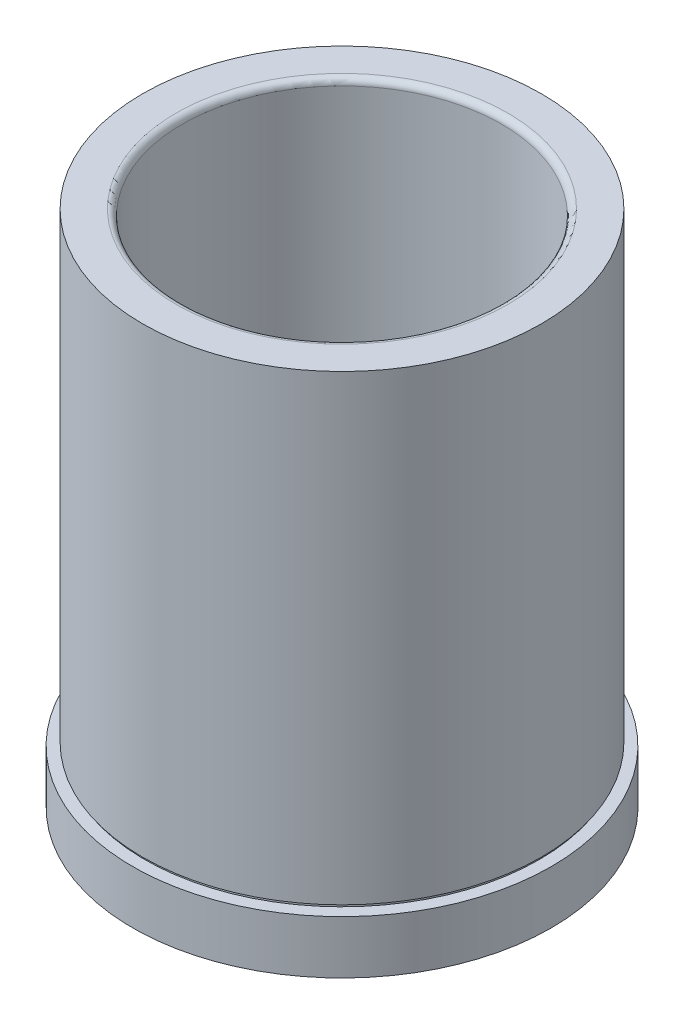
ISO-10303-21;
HEADER;
FILE_DESCRIPTION(('STEP AP214'),'2;1');
FILE_NAME('part.step','',(''),(''),'','','');
FILE_SCHEMA(('AUTOMOTIVE_DESIGN { 1 0 10303 214 1 1 1 1 }'));
ENDSEC;
DATA;
#1=APPLICATION_CONTEXT('core data for automotive mechanical design processes');
#2=APPLICATION_PROTOCOL_DEFINITION('international standard','automotive_design',2000,#1);
#3=PRODUCT_CONTEXT('',#1,'mechanical');
#4=PRODUCT('Part','Part','',(#3));
#5=PRODUCT_RELATED_PRODUCT_CATEGORY('part','',(#4));
#6=PRODUCT_DEFINITION_FORMATION('','',#4);
#7=PRODUCT_DEFINITION_CONTEXT('part definition',#1,'design');
#8=PRODUCT_DEFINITION('design','',#6,#7);
#9=PRODUCT_DEFINITION_SHAPE('','',#8);
#10=(LENGTH_UNIT() NAMED_UNIT(*) SI_UNIT(.MILLI.,.METRE.));
#11=(NAMED_UNIT(*) PLANE_ANGLE_UNIT() SI_UNIT($,.RADIAN.));
#12=(NAMED_UNIT(*) SI_UNIT($,.STERADIAN.) SOLID_ANGLE_UNIT());
#13=UNCERTAINTY_MEASURE_WITH_UNIT(LENGTH_MEASURE(1.E-05),#10,'distance_accuracy_value','');
#14=(GEOMETRIC_REPRESENTATION_CONTEXT(3) GLOBAL_UNCERTAINTY_ASSIGNED_CONTEXT((#13)) GLOBAL_UNIT_ASSIGNED_CONTEXT((#10,
#11,#12)) REPRESENTATION_CONTEXT('',''));
#15=CARTESIAN_POINT('',(0.,0.,0.));
#16=DIRECTION('',(0.,0.,1.));
#17=DIRECTION('',(1.,0.,0.));
#18=AXIS2_PLACEMENT_3D('',#15,#16,#17);
#19=CARTESIAN_POINT('',(-47.63135,139.750690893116,0.));
#20=DIRECTION('',(0.,-1.,0.));
#21=DIRECTION('',(1.,0.,0.));
#22=AXIS2_PLACEMENT_3D('',#19,#20,#21);
#23=PLANE('',#22);
#24=CARTESIAN_POINT('',(-4.87937211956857E-13,139.750690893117,0.));
#25=DIRECTION('',(0.,-1.,0.));
#26=DIRECTION('',(1.,0.,0.));
#27=AXIS2_PLACEMENT_3D('',#24,#25,#26);
#28=CIRCLE('',#27,39.6303499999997);
#29=CARTESIAN_POINT('',(39.6303499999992,139.750690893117,0.));
#30=VERTEX_POINT('',#29);
#31=EDGE_CURVE('E35',#30,#30,#28,.T.);
#32=ORIENTED_EDGE('',*,*,#31,.T.);
#33=EDGE_LOOP('',(#32));
#34=FACE_BOUND('',#33,.T.);
#35=CARTESIAN_POINT('',(-4.87937211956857E-13,139.750690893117,0.));
#36=DIRECTION('',(0.,-1.,0.));
#37=DIRECTION('',(1.,0.,0.));
#38=AXIS2_PLACEMENT_3D('',#35,#36,#37);
#39=CIRCLE('',#38,47.6313499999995);
#40=CARTESIAN_POINT('',(47.631349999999,139.750690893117,0.));
#41=VERTEX_POINT('',#40);
#42=EDGE_CURVE('E63',#41,#41,#39,.T.);
#43=ORIENTED_EDGE('',*,*,#42,.F.);
#44=EDGE_LOOP('',(#43));
#45=FACE_BOUND('',#44,.T.);
#46=ADVANCED_FACE('F28',(#34,#45),#23,.F.);
#47=CARTESIAN_POINT('',(3.49148336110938E-12,-1000.,0.));
#48=DIRECTION('',(0.,-1.,0.));
#49=DIRECTION('',(1.,0.,0.));
#50=AXIS2_PLACEMENT_3D('',#47,#48,#49);
#51=CYLINDRICAL_SURFACE('',#50,38.1063499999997);
#52=CARTESIAN_POINT('',(-4.82616191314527E-13,138.226690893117,0.));
#53=DIRECTION('',(0.,-1.,0.));
#54=DIRECTION('',(1.,0.,0.));
#55=AXIS2_PLACEMENT_3D('',#52,#53,#54);
#56=CIRCLE('',#55,38.1063499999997);
#57=CARTESIAN_POINT('',(38.1063499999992,138.226690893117,0.));
#58=VERTEX_POINT('',#57);
#59=EDGE_CURVE('E10',#58,#58,#56,.F.);
#60=ORIENTED_EDGE('',*,*,#59,.T.);
#61=EDGE_LOOP('',(#60));
#62=FACE_BOUND('',#61,.T.);
#63=CARTESIAN_POINT('',(0.,16.7417464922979,0.));
#64=DIRECTION('',(0.,-1.,0.));
#65=DIRECTION('',(1.,0.,0.));
#66=AXIS2_PLACEMENT_3D('',#63,#64,#65);
#67=CIRCLE('',#66,38.1063499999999);
#68=CARTESIAN_POINT('',(38.1063499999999,16.741746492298,0.));
#69=VERTEX_POINT('',#68);
#70=EDGE_CURVE('E39',#69,#69,#67,.T.);
#71=ORIENTED_EDGE('',*,*,#70,.T.);
#72=EDGE_LOOP('',(#71));
#73=FACE_BOUND('',#72,.T.);
#74=ADVANCED_FACE('F70',(#62,#73),#51,.F.);
#75=CARTESIAN_POINT('',(0.,15.9256908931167,0.));
#76=DIRECTION('',(0.,-1.,0.));
#77=DIRECTION('',(1.,0.,0.));
#78=AXIS2_PLACEMENT_3D('',#75,#76,#77);
#79=CONICAL_SURFACE('',#78,38.9224055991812,0.785398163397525);
#80=ORIENTED_EDGE('',*,*,#70,.F.);
#81=EDGE_LOOP('',(#80));
#82=FACE_BOUND('',#81,.T.);
#83=CARTESIAN_POINT('',(0.,15.9256908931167,0.));
#84=DIRECTION('',(0.,-1.,0.));
#85=DIRECTION('',(1.,0.,0.));
#86=AXIS2_PLACEMENT_3D('',#83,#84,#85);
#87=CIRCLE('',#86,38.9224055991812);
#88=CARTESIAN_POINT('',(38.9224055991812,15.9256908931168,0.));
#89=VERTEX_POINT('',#88);
#90=EDGE_CURVE('E43',#89,#89,#87,.T.);
#91=ORIENTED_EDGE('',*,*,#90,.T.);
#92=EDGE_LOOP('',(#91));
#93=FACE_BOUND('',#92,.T.);
#94=ADVANCED_FACE('F74',(#82,#93),#79,.F.);
#95=CARTESIAN_POINT('',(-38.9224055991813,15.9256908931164,0.));
#96=DIRECTION('',(0.,1.,0.));
#97=DIRECTION('',(-1.,0.,0.));
#98=AXIS2_PLACEMENT_3D('',#95,#96,#97);
#99=PLANE('',#98);
#100=ORIENTED_EDGE('',*,*,#90,.F.);
#101=EDGE_LOOP('',(#100));
#102=FACE_BOUND('',#101,.T.);
#103=CARTESIAN_POINT('',(0.,15.9256908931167,0.));
#104=DIRECTION('',(0.,-1.,0.));
#105=DIRECTION('',(1.,0.,0.));
#106=AXIS2_PLACEMENT_3D('',#103,#104,#105);
#107=CIRCLE('',#106,49.9998999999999);
#108=CARTESIAN_POINT('',(49.9998999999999,15.9256908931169,0.));
#109=VERTEX_POINT('',#108);
#110=EDGE_CURVE('E48',#109,#109,#107,.T.);
#111=ORIENTED_EDGE('',*,*,#110,.T.);
#112=EDGE_LOOP('',(#111));
#113=FACE_BOUND('',#112,.T.);
#114=ADVANCED_FACE('F79',(#102,#113),#99,.F.);
#115=CARTESIAN_POINT('',(3.49148336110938E-12,-1000.,0.));
#116=DIRECTION('',(0.,-1.,0.));
#117=DIRECTION('',(1.,0.,0.));
#118=AXIS2_PLACEMENT_3D('',#115,#116,#117);
#119=CYLINDRICAL_SURFACE('',#118,49.9998999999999);
#120=ORIENTED_EDGE('',*,*,#110,.F.);
#121=EDGE_LOOP('',(#120));
#122=FACE_BOUND('',#121,.T.);
#123=CARTESIAN_POINT('',(0.,28.6256908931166,0.));
#124=DIRECTION('',(0.,-1.,0.));
#125=DIRECTION('',(1.,0.,0.));
#126=AXIS2_PLACEMENT_3D('',#123,#124,#125);
#127=CIRCLE('',#126,49.9998999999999);
#128=CARTESIAN_POINT('',(49.9998999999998,28.6256908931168,0.));
#129=VERTEX_POINT('',#128);
#130=EDGE_CURVE('E51',#129,#129,#127,.T.);
#131=ORIENTED_EDGE('',*,*,#130,.T.);
#132=EDGE_LOOP('',(#131));
#133=FACE_BOUND('',#132,.T.);
#134=ADVANCED_FACE('F83',(#122,#133),#119,.T.);
#135=CARTESIAN_POINT('',(-49.9999,28.6256908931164,0.));
#136=DIRECTION('',(0.,-1.,0.));
#137=DIRECTION('',(1.,0.,0.));
#138=AXIS2_PLACEMENT_3D('',#135,#136,#137);
#139=PLANE('',#138);
#140=ORIENTED_EDGE('',*,*,#130,.F.);
#141=EDGE_LOOP('',(#140));
#142=FACE_BOUND('',#141,.T.);
#143=CARTESIAN_POINT('',(0.,28.6256908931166,0.));
#144=DIRECTION('',(0.,-1.,0.));
#145=DIRECTION('',(1.,0.,0.));
#146=AXIS2_PLACEMENT_3D('',#143,#144,#145);
#147=CIRCLE('',#146,47.1233499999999);
#148=CARTESIAN_POINT('',(47.1233499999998,28.6256908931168,0.));
#149=VERTEX_POINT('',#148);
#150=EDGE_CURVE('E54',#149,#149,#147,.T.);
#151=ORIENTED_EDGE('',*,*,#150,.T.);
#152=EDGE_LOOP('',(#151));
#153=FACE_BOUND('',#152,.T.);
#154=ADVANCED_FACE('F87',(#142,#153),#139,.F.);
#155=CARTESIAN_POINT('',(3.49148336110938E-12,-1000.,0.));
#156=DIRECTION('',(0.,-1.,0.));
#157=DIRECTION('',(1.,0.,0.));
#158=AXIS2_PLACEMENT_3D('',#155,#156,#157);
#159=CYLINDRICAL_SURFACE('',#158,47.1233499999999);
#160=ORIENTED_EDGE('',*,*,#150,.F.);
#161=EDGE_LOOP('',(#160));
#162=FACE_BOUND('',#161,.T.);
#163=CARTESIAN_POINT('',(-1.02606633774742E-13,29.3876908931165,0.));
#164=DIRECTION('',(0.,-1.,0.));
#165=DIRECTION('',(1.,0.,0.));
#166=AXIS2_PLACEMENT_3D('',#163,#164,#165);
#167=CIRCLE('',#166,47.1233499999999);
#168=CARTESIAN_POINT('',(47.1233499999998,29.3876908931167,0.));
#169=VERTEX_POINT('',#168);
#170=EDGE_CURVE('E57',#169,#169,#167,.T.);
#171=ORIENTED_EDGE('',*,*,#170,.T.);
#172=EDGE_LOOP('',(#171));
#173=FACE_BOUND('',#172,.T.);
#174=ADVANCED_FACE('F91',(#162,#173),#159,.T.);
#175=CARTESIAN_POINT('',(-47.63135,29.3876908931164,0.));
#176=DIRECTION('',(0.,1.,0.));
#177=DIRECTION('',(-1.,0.,0.));
#178=AXIS2_PLACEMENT_3D('',#175,#176,#177);
#179=PLANE('',#178);
#180=ORIENTED_EDGE('',*,*,#170,.F.);
#181=EDGE_LOOP('',(#180));
#182=FACE_BOUND('',#181,.T.);
#183=CARTESIAN_POINT('',(-1.02606633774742E-13,29.3876908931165,0.));
#184=DIRECTION('',(0.,-1.,0.));
#185=DIRECTION('',(1.,0.,0.));
#186=AXIS2_PLACEMENT_3D('',#183,#184,#185);
#187=CIRCLE('',#186,47.6313499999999);
#188=CARTESIAN_POINT('',(47.6313499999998,29.3876908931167,0.));
#189=VERTEX_POINT('',#188);
#190=EDGE_CURVE('E60',#189,#189,#187,.T.);
#191=ORIENTED_EDGE('',*,*,#190,.T.);
#192=EDGE_LOOP('',(#191));
#193=FACE_BOUND('',#192,.T.);
#194=ADVANCED_FACE('F95',(#182,#193),#179,.F.);
#195=CARTESIAN_POINT('',(3.49148336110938E-12,-1000.,0.));
#196=DIRECTION('',(0.,-1.,0.));
#197=DIRECTION('',(1.,0.,0.));
#198=AXIS2_PLACEMENT_3D('',#195,#196,#197);
#199=CYLINDRICAL_SURFACE('',#198,47.6313499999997);
#200=ORIENTED_EDGE('',*,*,#190,.F.);
#201=EDGE_LOOP('',(#200));
#202=FACE_BOUND('',#201,.T.);
#203=ORIENTED_EDGE('',*,*,#42,.T.);
#204=EDGE_LOOP('',(#203));
#205=FACE_BOUND('',#204,.T.);
#206=ADVANCED_FACE('F67',(#202,#205),#199,.T.);
#207=CARTESIAN_POINT('',(-4.82616191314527E-13,138.226690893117,0.));
#208=DIRECTION('',(0.,-1.,0.));
#209=DIRECTION('',(1.,0.,0.));
#210=AXIS2_PLACEMENT_3D('',#207,#208,#209);
#211=TOROIDAL_SURFACE('',#210,39.6303499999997,1.524);
#212=ORIENTED_EDGE('',*,*,#59,.F.);
#213=EDGE_LOOP('',(#212));
#214=FACE_BOUND('',#213,.T.);
#215=ORIENTED_EDGE('',*,*,#31,.F.);
#216=EDGE_LOOP('',(#215));
#217=FACE_BOUND('',#216,.T.);
#218=ADVANCED_FACE('F30',(#214,#217),#211,.T.);
#219=CLOSED_SHELL('',(#46,#74,#94,#114,#134,#154,#174,#194,#206,#218));
#220=MANIFOLD_SOLID_BREP('B2',#219);
#221=ADVANCED_BREP_SHAPE_REPRESENTATION('',(#18,#220),#14);
#222=SHAPE_DEFINITION_REPRESENTATION(#9,#221);
ENDSEC;
END-ISO-10303-21;
